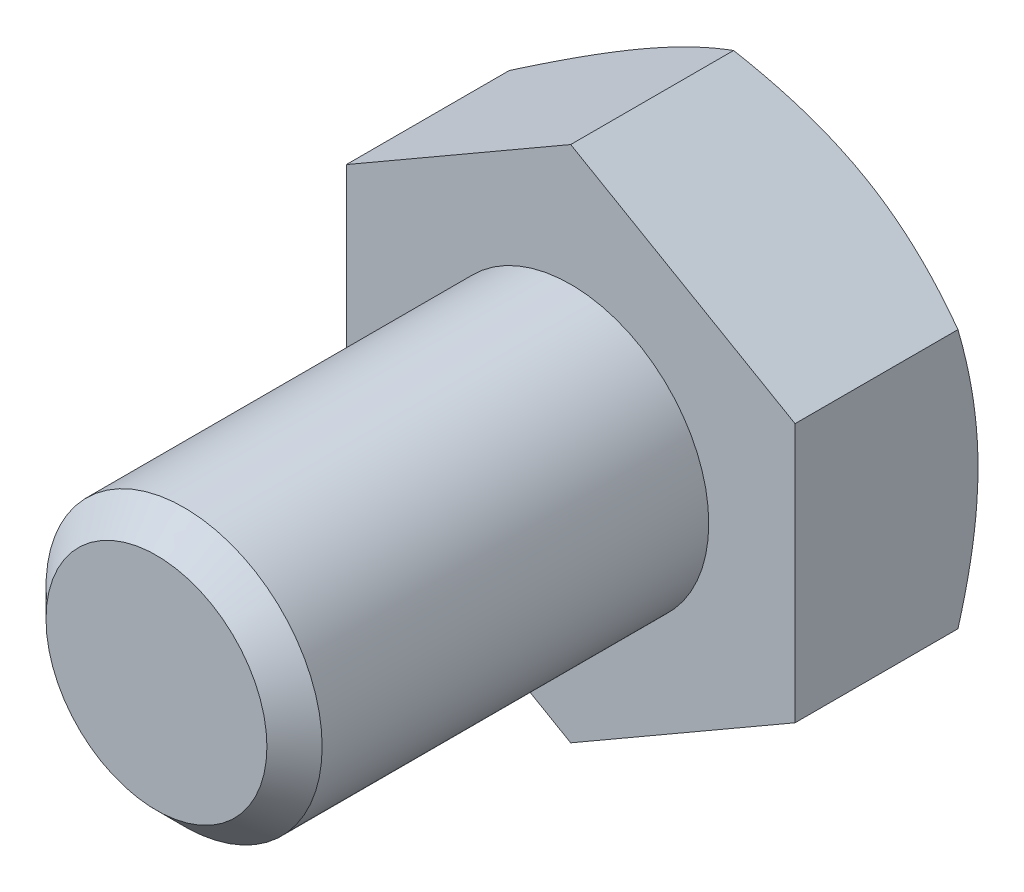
ISO-10303-21;
HEADER;
FILE_DESCRIPTION(('STEP AP214'),'2;1');
FILE_NAME('part.step','',(''),(''),'','','');
FILE_SCHEMA(('AUTOMOTIVE_DESIGN { 1 0 10303 214 1 1 1 1 }'));
ENDSEC;
DATA;
#1=APPLICATION_CONTEXT('core data for automotive mechanical design processes');
#2=APPLICATION_PROTOCOL_DEFINITION('international standard','automotive_design',2000,#1);
#3=PRODUCT_CONTEXT('',#1,'mechanical');
#4=PRODUCT('Part','Part','',(#3));
#5=PRODUCT_RELATED_PRODUCT_CATEGORY('part','',(#4));
#6=PRODUCT_DEFINITION_FORMATION('','',#4);
#7=PRODUCT_DEFINITION_CONTEXT('part definition',#1,'design');
#8=PRODUCT_DEFINITION('design','',#6,#7);
#9=PRODUCT_DEFINITION_SHAPE('','',#8);
#10=(LENGTH_UNIT() NAMED_UNIT(*) SI_UNIT(.MILLI.,.METRE.));
#11=(NAMED_UNIT(*) PLANE_ANGLE_UNIT() SI_UNIT($,.RADIAN.));
#12=(NAMED_UNIT(*) SI_UNIT($,.STERADIAN.) SOLID_ANGLE_UNIT());
#13=UNCERTAINTY_MEASURE_WITH_UNIT(LENGTH_MEASURE(1.E-05),#10,'distance_accuracy_value','');
#14=(GEOMETRIC_REPRESENTATION_CONTEXT(3) GLOBAL_UNCERTAINTY_ASSIGNED_CONTEXT((#13)) GLOBAL_UNIT_ASSIGNED_CONTEXT((#10,
#11,#12)) REPRESENTATION_CONTEXT('',''));
#15=CARTESIAN_POINT('',(0.,0.,0.));
#16=DIRECTION('',(0.,0.,1.));
#17=DIRECTION('',(1.,0.,0.));
#18=AXIS2_PLACEMENT_3D('',#15,#16,#17);
#19=CARTESIAN_POINT('',(0.,0.,12.));
#20=DIRECTION('',(0.,0.,1.));
#21=DIRECTION('',(1.,0.,0.));
#22=AXIS2_PLACEMENT_3D('',#19,#20,#21);
#23=PLANE('',#22);
#24=CARTESIAN_POINT('',(0.,0.,12.));
#25=DIRECTION('',(0.,0.,1.));
#26=DIRECTION('',(1.,0.,0.));
#27=AXIS2_PLACEMENT_3D('',#24,#25,#26);
#28=CIRCLE('',#27,3.2);
#29=CARTESIAN_POINT('',(3.2,0.,12.));
#30=VERTEX_POINT('',#29);
#31=EDGE_CURVE('E271',#30,#30,#28,.T.);
#32=ORIENTED_EDGE('',*,*,#31,.T.);
#33=EDGE_LOOP('',(#32));
#34=FACE_BOUND('',#33,.T.);
#35=ADVANCED_FACE('F34',(#34),#23,.T.);
#36=CARTESIAN_POINT('',(0.,0.,0.));
#37=DIRECTION('',(0.,0.,1.));
#38=DIRECTION('',(1.,0.,0.));
#39=AXIS2_PLACEMENT_3D('',#36,#37,#38);
#40=CYLINDRICAL_SURFACE('',#39,4.);
#41=CARTESIAN_POINT('',(0.,0.,11.2));
#42=DIRECTION('',(0.,0.,1.));
#43=DIRECTION('',(1.,0.,0.));
#44=AXIS2_PLACEMENT_3D('',#41,#42,#43);
#45=CIRCLE('',#44,4.);
#46=CARTESIAN_POINT('',(4.,0.,11.2));
#47=VERTEX_POINT('',#46);
#48=EDGE_CURVE('E242',#47,#47,#45,.F.);
#49=ORIENTED_EDGE('',*,*,#48,.T.);
#50=EDGE_LOOP('',(#49));
#51=FACE_BOUND('',#50,.T.);
#52=CARTESIAN_POINT('',(0.,0.,0.));
#53=DIRECTION('',(0.,0.,1.));
#54=DIRECTION('',(1.,0.,0.));
#55=AXIS2_PLACEMENT_3D('',#52,#53,#54);
#56=CIRCLE('',#55,4.);
#57=CARTESIAN_POINT('',(4.,0.,0.));
#58=VERTEX_POINT('',#57);
#59=EDGE_CURVE('E268',#58,#58,#56,.F.);
#60=ORIENTED_EDGE('',*,*,#59,.F.);
#61=EDGE_LOOP('',(#60));
#62=FACE_BOUND('',#61,.T.);
#63=ADVANCED_FACE('F206',(#51,#62),#40,.T.);
#64=CARTESIAN_POINT('',(0.,0.,12.));
#65=DIRECTION('',(0.,0.,-1.));
#66=DIRECTION('',(-1.,0.,0.));
#67=AXIS2_PLACEMENT_3D('',#64,#65,#66);
#68=CONICAL_SURFACE('',#67,3.2,0.785398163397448);
#69=ORIENTED_EDGE('',*,*,#48,.F.);
#70=EDGE_LOOP('',(#69));
#71=FACE_BOUND('',#70,.T.);
#72=ORIENTED_EDGE('',*,*,#31,.F.);
#73=EDGE_LOOP('',(#72));
#74=FACE_BOUND('',#73,.T.);
#75=ADVANCED_FACE('F36',(#71,#74),#68,.T.);
#76=CARTESIAN_POINT('',(0.,7.50555349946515,-5.3));
#77=DIRECTION('',(0.499999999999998,0.86602540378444,0.));
#78=DIRECTION('',(-0.86602540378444,0.499999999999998,0.));
#79=AXIS2_PLACEMENT_3D('',#76,#77,#78);
#80=PLANE('',#79);
#81=CARTESIAN_POINT('',(-0.000200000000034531,7.50566896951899,-4.71937674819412));
#82=CARTESIAN_POINT('',(0.142677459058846,7.42317863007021,-4.7669955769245));
#83=CARTESIAN_POINT('',(0.286087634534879,7.3403807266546,-4.81245329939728));
#84=CARTESIAN_POINT('',(0.574072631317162,7.17411251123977,-4.89845131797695));
#85=CARTESIAN_POINT('',(0.718647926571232,7.09064192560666,-4.93898949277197));
#86=CARTESIAN_POINT('',(1.15468865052,6.8388936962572,-5.05242899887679));
#87=CARTESIAN_POINT('',(1.44787528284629,6.66962231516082,-5.11695219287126));
#88=CARTESIAN_POINT('',(1.88662374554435,6.41631077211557,-5.19261341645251));
#89=CARTESIAN_POINT('',(2.03087463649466,6.33302748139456,-5.21416714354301));
#90=CARTESIAN_POINT('',(2.32002821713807,6.16608458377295,-5.25030968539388));
#91=CARTESIAN_POINT('',(2.46493084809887,6.08242501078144,-5.26489911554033));
#92=CARTESIAN_POINT('',(2.7549877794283,5.91496056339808,-5.28674124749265));
#93=CARTESIAN_POINT('',(2.90014160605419,5.83115596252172,-5.29400227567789));
#94=CARTESIAN_POINT('',(3.19057533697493,5.66347396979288,-5.30103969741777));
#95=CARTESIAN_POINT('',(3.33585523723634,5.57959658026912,-5.30081632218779));
#96=CARTESIAN_POINT('',(3.73387594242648,5.34979921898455,-5.28991654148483));
#97=CARTESIAN_POINT('',(3.98648646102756,5.20395446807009,-5.27161818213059));
#98=CARTESIAN_POINT('',(4.49002967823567,4.91323365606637,-5.21359365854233));
#99=CARTESIAN_POINT('',(4.74096060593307,4.76835861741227,-5.17384766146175));
#100=CARTESIAN_POINT('',(5.24551722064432,4.47705272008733,-5.07449409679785));
#101=CARTESIAN_POINT('',(5.49907924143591,4.33065861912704,-5.01446557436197));
#102=CARTESIAN_POINT('',(6.00242193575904,4.04005357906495,-4.87822500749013));
#103=CARTESIAN_POINT('',(6.25220905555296,3.89583891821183,-4.8020449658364));
#104=CARTESIAN_POINT('',(6.5002,3.75266127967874,-4.71937674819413));
#105=B_SPLINE_CURVE_WITH_KNOTS('',3,(#81,#82,#83,#84,#85,#86,#87,#88,#89,#90,#91,#92,#93,#94,
#95,#96,#97,#98,#99,#100,#101,#102,#103,#104),.UNSPECIFIED.,.F.,.F.,(4,2,2,2,2,2,2,2,2,2,2,4),
(0.,0.515105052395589,1.03043143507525,2.06322554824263,2.56697389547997,3.07067772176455,
3.57380860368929,4.07692394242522,4.95279354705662,5.82947446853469,6.72559912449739,
7.61996451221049),.UNSPECIFIED.);
#106=CARTESIAN_POINT('',(0.,7.50555349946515,-4.71944341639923));
#107=VERTEX_POINT('',#106);
#108=CARTESIAN_POINT('',(3.24999999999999,5.62916512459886,-5.3));
#109=VERTEX_POINT('',#108);
#110=EDGE_CURVE('E230',#107,#109,#105,.T.);
#111=ORIENTED_EDGE('',*,*,#110,.F.);
#112=DIRECTION('',(0.,0.,1.));
#113=VECTOR('',#112,1.);
#114=CARTESIAN_POINT('',(0.,7.50555349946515,-5.3));
#115=LINE('',#114,#113);
#116=CARTESIAN_POINT('',(0.,7.50555349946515,0.));
#117=VERTEX_POINT('',#116);
#118=EDGE_CURVE('E227',#107,#117,#115,.T.);
#119=ORIENTED_EDGE('',*,*,#118,.T.);
#120=DIRECTION('',(-0.86602540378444,0.499999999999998,0.));
#121=VECTOR('',#120,1.);
#122=CARTESIAN_POINT('',(0.,7.50555349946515,0.));
#123=LINE('',#122,#121);
#124=CARTESIAN_POINT('',(6.5,3.75277674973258,0.));
#125=VERTEX_POINT('',#124);
#126=EDGE_CURVE('E235',#125,#117,#123,.T.);
#127=ORIENTED_EDGE('',*,*,#126,.F.);
#128=DIRECTION('',(0.,0.,1.));
#129=VECTOR('',#128,1.);
#130=CARTESIAN_POINT('',(6.5,3.75277674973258,-5.3));
#131=LINE('',#130,#129);
#132=CARTESIAN_POINT('',(6.5,3.75277674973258,-4.71944341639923));
#133=VERTEX_POINT('',#132);
#134=EDGE_CURVE('E260',#133,#125,#131,.T.);
#135=ORIENTED_EDGE('',*,*,#134,.F.);
#136=EDGE_CURVE('E179',#109,#133,#105,.T.);
#137=ORIENTED_EDGE('',*,*,#136,.F.);
#138=EDGE_LOOP('',(#111,#119,#127,#135,#137));
#139=FACE_BOUND('',#138,.T.);
#140=ADVANCED_FACE('F190',(#139),#80,.T.);
#141=CARTESIAN_POINT('',(6.5,-3.75277674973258,-5.3));
#142=DIRECTION('',(1.,0.,0.));
#143=DIRECTION('',(0.,0.,-1.));
#144=AXIS2_PLACEMENT_3D('',#141,#142,#143);
#145=PLANE('',#144);
#146=CARTESIAN_POINT('',(6.5,-10.2428264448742,-2.04883753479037));
#147=CARTESIAN_POINT('',(6.5,-9.95749123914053,-2.18789595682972));
#148=CARTESIAN_POINT('',(6.5,-9.67151814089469,-2.32566707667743));
#149=CARTESIAN_POINT('',(6.5,-9.0979574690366,-2.59791370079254));
#150=CARTESIAN_POINT('',(6.5,-8.81036966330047,-2.73238871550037));
#151=CARTESIAN_POINT('',(6.5,-8.23183597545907,-2.99796413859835));
#152=CARTESIAN_POINT('',(6.5,-7.94088042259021,-3.12904355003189));
#153=CARTESIAN_POINT('',(6.5,-7.35671087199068,-3.38604980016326));
#154=CARTESIAN_POINT('',(6.5,-7.06349697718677,-3.51197687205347));
#155=CARTESIAN_POINT('',(6.5,-6.46434920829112,-3.7614858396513));
#156=CARTESIAN_POINT('',(6.5,-6.15832132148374,-3.88484316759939));
#157=CARTESIAN_POINT('',(6.5,-5.54274557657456,-4.12260875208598));
#158=CARTESIAN_POINT('',(6.5,-5.23319733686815,-4.2370160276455));
#159=CARTESIAN_POINT('',(6.5,-4.61061796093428,-4.45399730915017));
#160=CARTESIAN_POINT('',(6.5,-4.29759477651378,-4.5565939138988));
#161=CARTESIAN_POINT('',(6.5,-3.66705774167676,-4.74676876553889));
#162=CARTESIAN_POINT('',(6.5,-3.34954528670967,-4.83435157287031));
#163=CARTESIAN_POINT('',(6.5,-2.71162315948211,-4.98994277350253));
#164=CARTESIAN_POINT('',(6.5,-2.3912406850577,-5.05806094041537));
#165=CARTESIAN_POINT('',(6.5,-1.74628166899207,-5.17096432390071));
#166=CARTESIAN_POINT('',(6.5,-1.4217055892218,-5.2157520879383));
#167=CARTESIAN_POINT('',(6.5,-0.935153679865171,-5.26247031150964));
#168=CARTESIAN_POINT('',(6.5,-0.774120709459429,-5.27461755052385));
#169=CARTESIAN_POINT('',(6.5,-0.451677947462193,-5.29209027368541));
#170=CARTESIAN_POINT('',(6.5,-0.290268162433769,-5.29741587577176));
#171=CARTESIAN_POINT('',(6.5,0.0326315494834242,-5.30111032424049));
#172=CARTESIAN_POINT('',(6.5,0.194121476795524,-5.29947913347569));
#173=CARTESIAN_POINT('',(6.5,0.516885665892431,-5.28930353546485));
#174=CARTESIAN_POINT('',(6.5,0.678159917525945,-5.2807588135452));
#175=CARTESIAN_POINT('',(6.5,1.06087214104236,-5.2524625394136));
#176=CARTESIAN_POINT('',(6.5,1.28209274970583,-5.22970222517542));
#177=CARTESIAN_POINT('',(6.5,1.72298724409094,-5.17237790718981));
#178=CARTESIAN_POINT('',(6.5,1.94266093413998,-5.13781243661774));
#179=CARTESIAN_POINT('',(6.5,2.59905068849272,-5.01823337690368));
#180=CARTESIAN_POINT('',(6.5,3.03292018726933,-4.91735524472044));
#181=CARTESIAN_POINT('',(6.5,3.68203059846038,-4.74117763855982));
#182=CARTESIAN_POINT('',(6.5,3.90060192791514,-4.67743243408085));
#183=CARTESIAN_POINT('',(6.5,4.33562456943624,-4.54301317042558));
#184=CARTESIAN_POINT('',(6.5,4.55207586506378,-4.47233905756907));
#185=CARTESIAN_POINT('',(6.5,4.98292314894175,-4.3252213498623));
#186=CARTESIAN_POINT('',(6.5,5.19731969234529,-4.24877936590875));
#187=CARTESIAN_POINT('',(6.5,5.6243136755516,-4.09105605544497));
#188=CARTESIAN_POINT('',(6.5,5.83691115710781,-4.00977484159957));
#189=CARTESIAN_POINT('',(6.5,6.41107024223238,-3.78396124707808));
#190=CARTESIAN_POINT('',(6.5,6.77109993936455,-3.63553740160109));
#191=CARTESIAN_POINT('',(6.5,7.48742894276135,-3.32991367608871));
#192=CARTESIAN_POINT('',(6.5,7.84372782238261,-3.17271280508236));
#193=CARTESIAN_POINT('',(6.5,8.55345570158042,-2.85162072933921));
#194=CARTESIAN_POINT('',(6.5,8.90688352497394,-2.68772693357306));
#195=CARTESIAN_POINT('',(6.5,9.6113113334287,-2.35485675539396));
#196=CARTESIAN_POINT('',(6.5,9.9623114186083,-2.18588058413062));
#197=CARTESIAN_POINT('',(6.5,10.6629371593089,-1.84367823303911));
#198=CARTESIAN_POINT('',(6.5,11.012559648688,-1.67044558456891));
#199=CARTESIAN_POINT('',(6.5,11.7102232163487,-1.32082260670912));
#200=CARTESIAN_POINT('',(6.5,12.058264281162,-1.14443225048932));
#201=CARTESIAN_POINT('',(6.5,12.7529700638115,-0.78915631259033));
#202=CARTESIAN_POINT('',(6.5,13.099635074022,-0.610271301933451));
#203=CARTESIAN_POINT('',(6.5,13.7918918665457,-0.25043541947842));
#204=CARTESIAN_POINT('',(6.5,14.1374836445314,-0.0694845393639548));
#205=CARTESIAN_POINT('',(6.5,15.099399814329,0.437179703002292));
#206=CARTESIAN_POINT('',(6.5,15.7147468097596,0.764748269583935));
#207=CARTESIAN_POINT('',(6.5,16.9433793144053,1.42381233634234));
#208=CARTESIAN_POINT('',(6.5,17.5566646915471,1.7553080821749));
#209=CARTESIAN_POINT('',(6.5,18.779571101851,2.4200871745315));
#210=CARTESIAN_POINT('',(6.5,19.3891975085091,2.75336064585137));
#211=CARTESIAN_POINT('',(6.5,20.6071616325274,3.42213981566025));
#212=CARTESIAN_POINT('',(6.5,21.2154994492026,3.75764533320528));
#213=CARTESIAN_POINT('',(6.5,21.8233856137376,4.09396124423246));
#214=B_SPLINE_CURVE_WITH_KNOTS('',3,(#146,#147,#148,#149,#150,#151,#152,#153,#154,#155,#156,
#157,#158,#159,#160,#161,#162,#163,#164,#165,#166,#167,#168,#169,#170,#171,#172,#173,#174,#175,
#176,#177,#178,#179,#180,#181,#182,#183,#184,#185,#186,#187,#188,#189,#190,#191,#192,#193,#194,
#195,#196,#197,#198,#199,#200,#201,#202,#203,#204,#205,#206,#207,#208,#209,#210,#211,#212,#213),
.UNSPECIFIED.,.F.,.F.,(4,2,2,2,2,2,2,2,2,2,2,2,2,2,2,2,2,2,2,2,2,2,2,2,2,2,2,2,2,2,2,2,2,4),(0.,
0.952261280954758,1.90466315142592,2.8619801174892,3.81925370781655,4.8090096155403,
5.798873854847,6.78681142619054,7.7744483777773,8.75640022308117,9.73824482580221,
10.2225937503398,10.7069343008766,11.1912774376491,11.6756426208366,12.3424346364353,
13.0093095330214,14.3437044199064,15.0266742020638,15.7096492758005,16.3924343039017,
17.0752034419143,18.2433007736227,19.4115302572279,20.580216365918,21.7488539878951,
22.9193933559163,24.0899426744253,25.2602283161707,26.4305186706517,28.5218066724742,
30.6132261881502,32.6975528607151,34.7817125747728),.UNSPECIFIED.);
#215=CARTESIAN_POINT('',(6.5,0.,-5.3));
#216=VERTEX_POINT('',#215);
#217=EDGE_CURVE('E177',#133,#216,#214,.F.);
#218=ORIENTED_EDGE('',*,*,#217,.F.);
#219=ORIENTED_EDGE('',*,*,#134,.T.);
#220=DIRECTION('',(0.,1.,0.));
#221=VECTOR('',#220,1.);
#222=CARTESIAN_POINT('',(6.5,-3.75277674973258,0.));
#223=LINE('',#222,#221);
#224=CARTESIAN_POINT('',(6.5,-3.75277674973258,0.));
#225=VERTEX_POINT('',#224);
#226=EDGE_CURVE('E267',#225,#125,#223,.T.);
#227=ORIENTED_EDGE('',*,*,#226,.F.);
#228=DIRECTION('',(0.,0.,1.));
#229=VECTOR('',#228,1.);
#230=CARTESIAN_POINT('',(6.5,-3.75277674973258,-5.3));
#231=LINE('',#230,#229);
#232=CARTESIAN_POINT('',(6.5,-3.75277674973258,-4.71944341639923));
#233=VERTEX_POINT('',#232);
#234=EDGE_CURVE('E245',#233,#225,#231,.T.);
#235=ORIENTED_EDGE('',*,*,#234,.F.);
#236=EDGE_CURVE('E171',#216,#233,#214,.F.);
#237=ORIENTED_EDGE('',*,*,#236,.F.);
#238=EDGE_LOOP('',(#218,#219,#227,#235,#237));
#239=FACE_BOUND('',#238,.T.);
#240=ADVANCED_FACE('F186',(#239),#145,.T.);
#241=CARTESIAN_POINT('',(0.,-7.50555349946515,-5.3));
#242=DIRECTION('',(0.499999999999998,-0.86602540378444,0.));
#243=DIRECTION('',(0.86602540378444,0.499999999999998,0.));
#244=AXIS2_PLACEMENT_3D('',#241,#242,#243);
#245=PLANE('',#244);
#246=CARTESIAN_POINT('',(6.5002,-3.75266127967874,-4.71937674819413));
#247=CARTESIAN_POINT('',(6.35732254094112,-3.83515161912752,-4.76699557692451));
#248=CARTESIAN_POINT('',(6.21391236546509,-3.91794952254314,-4.81245329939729));
#249=CARTESIAN_POINT('',(5.92592736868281,-4.08421773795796,-4.89845131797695));
#250=CARTESIAN_POINT('',(5.78135207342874,-4.16768832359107,-4.93898949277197));
#251=CARTESIAN_POINT('',(5.34531134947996,-4.41943655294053,-5.05242899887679));
#252=CARTESIAN_POINT('',(5.05212471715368,-4.58870793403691,-5.11695219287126));
#253=CARTESIAN_POINT('',(4.61337625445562,-4.84201947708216,-5.19261341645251));
#254=CARTESIAN_POINT('',(4.46912536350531,-4.92530276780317,-5.21416714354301));
#255=CARTESIAN_POINT('',(4.17997178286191,-5.09224566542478,-5.25030968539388));
#256=CARTESIAN_POINT('',(4.03506915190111,-5.17590523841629,-5.26489911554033));
#257=CARTESIAN_POINT('',(3.74501222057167,-5.34336968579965,-5.28674124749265));
#258=CARTESIAN_POINT('',(3.59985839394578,-5.42717428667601,-5.29400227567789));
#259=CARTESIAN_POINT('',(3.30942466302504,-5.59485627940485,-5.30103969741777));
#260=CARTESIAN_POINT('',(3.16414476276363,-5.67873366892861,-5.30081632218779));
#261=CARTESIAN_POINT('',(2.76612405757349,-5.90853103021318,-5.28991654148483));
#262=CARTESIAN_POINT('',(2.51351353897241,-6.05437578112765,-5.27161818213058));
#263=CARTESIAN_POINT('',(2.0099703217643,-6.34509659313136,-5.21359365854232));
#264=CARTESIAN_POINT('',(1.7590393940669,-6.48997163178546,-5.17384766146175));
#265=CARTESIAN_POINT('',(1.25448277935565,-6.7812775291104,-5.07449409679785));
#266=CARTESIAN_POINT('',(1.00092075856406,-6.92767163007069,-5.01446557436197));
#267=CARTESIAN_POINT('',(0.497578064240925,-7.21827667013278,-4.87822500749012));
#268=CARTESIAN_POINT('',(0.247790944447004,-7.3624913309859,-4.8020449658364));
#269=CARTESIAN_POINT('',(-0.000200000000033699,-7.50566896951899,-4.71937674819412));
#270=B_SPLINE_CURVE_WITH_KNOTS('',3,(#246,#247,#248,#249,#250,#251,#252,#253,#254,#255,#256,
#257,#258,#259,#260,#261,#262,#263,#264,#265,#266,#267,#268,#269),.UNSPECIFIED.,.F.,.F.,(4,2,2,
2,2,2,2,2,2,2,2,4),(0.,0.515105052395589,1.03043143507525,2.06322554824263,2.56697389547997,
3.07067772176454,3.57380860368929,4.07692394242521,4.95279354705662,5.82947446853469,
6.72559912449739,7.61996451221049),.UNSPECIFIED.);
#271=CARTESIAN_POINT('',(3.24999999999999,-5.62916512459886,-5.3));
#272=VERTEX_POINT('',#271);
#273=EDGE_CURVE('E178',#233,#272,#270,.T.);
#274=ORIENTED_EDGE('',*,*,#273,.F.);
#275=ORIENTED_EDGE('',*,*,#234,.T.);
#276=DIRECTION('',(0.86602540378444,0.499999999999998,0.));
#277=VECTOR('',#276,1.);
#278=CARTESIAN_POINT('',(0.,-7.50555349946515,0.));
#279=LINE('',#278,#277);
#280=CARTESIAN_POINT('',(0.,-7.50555349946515,0.));
#281=VERTEX_POINT('',#280);
#282=EDGE_CURVE('E256',#281,#225,#279,.T.);
#283=ORIENTED_EDGE('',*,*,#282,.F.);
#284=DIRECTION('',(0.,0.,1.));
#285=VECTOR('',#284,1.);
#286=CARTESIAN_POINT('',(0.,-7.50555349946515,-5.3));
#287=LINE('',#286,#285);
#288=CARTESIAN_POINT('',(0.,-7.50555349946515,-4.71944341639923));
#289=VERTEX_POINT('',#288);
#290=EDGE_CURVE('E255',#289,#281,#287,.T.);
#291=ORIENTED_EDGE('',*,*,#290,.F.);
#292=EDGE_CURVE('E164',#272,#289,#270,.T.);
#293=ORIENTED_EDGE('',*,*,#292,.F.);
#294=EDGE_LOOP('',(#274,#275,#283,#291,#293));
#295=FACE_BOUND('',#294,.T.);
#296=ADVANCED_FACE('F189',(#295),#245,.T.);
#297=CARTESIAN_POINT('',(0.,-7.50555349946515,-5.3));
#298=DIRECTION('',(-0.500000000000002,-0.866025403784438,0.));
#299=DIRECTION('',(0.866025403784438,-0.500000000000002,0.));
#300=AXIS2_PLACEMENT_3D('',#297,#298,#299);
#301=PLANE('',#300);
#302=CARTESIAN_POINT('',(0.000199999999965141,-7.50566896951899,-4.71937674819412));
#303=CARTESIAN_POINT('',(-0.142677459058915,-7.42317863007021,-4.7669955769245));
#304=CARTESIAN_POINT('',(-0.286087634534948,-7.34038072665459,-4.81245329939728));
#305=CARTESIAN_POINT('',(-0.57407263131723,-7.17411251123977,-4.89845131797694));
#306=CARTESIAN_POINT('',(-0.7186479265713,-7.09064192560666,-4.93898949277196));
#307=CARTESIAN_POINT('',(-1.15468865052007,-6.8388936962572,-5.05242899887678));
#308=CARTESIAN_POINT('',(-1.44787528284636,-6.66962231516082,-5.11695219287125));
#309=CARTESIAN_POINT('',(-1.88662374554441,-6.41631077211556,-5.1926134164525));
#310=CARTESIAN_POINT('',(-2.03087463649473,-6.33302748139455,-5.214167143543));
#311=CARTESIAN_POINT('',(-2.32002821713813,-6.16608458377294,-5.25030968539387));
#312=CARTESIAN_POINT('',(-2.46493084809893,-6.08242501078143,-5.26489911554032));
#313=CARTESIAN_POINT('',(-2.75498777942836,-5.91496056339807,-5.28674124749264));
#314=CARTESIAN_POINT('',(-2.90014160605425,-5.83115596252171,-5.29400227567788));
#315=CARTESIAN_POINT('',(-3.19057533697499,-5.66347396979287,-5.30103969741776));
#316=CARTESIAN_POINT('',(-3.3358552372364,-5.5795965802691,-5.30081632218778));
#317=CARTESIAN_POINT('',(-3.73387594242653,-5.34979921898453,-5.28991654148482));
#318=CARTESIAN_POINT('',(-3.98648646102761,-5.20395446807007,-5.27161818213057));
#319=CARTESIAN_POINT('',(-4.49002967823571,-4.91323365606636,-5.21359365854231));
#320=CARTESIAN_POINT('',(-4.74096060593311,-4.76835861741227,-5.17384766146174));
#321=CARTESIAN_POINT('',(-5.24551722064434,-4.47705272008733,-5.07449409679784));
#322=CARTESIAN_POINT('',(-5.49907924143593,-4.33065861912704,-5.01446557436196));
#323=CARTESIAN_POINT('',(-6.00242193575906,-4.04005357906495,-4.87822500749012));
#324=CARTESIAN_POINT('',(-6.25220905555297,-3.89583891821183,-4.8020449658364));
#325=CARTESIAN_POINT('',(-6.5002,-3.75266127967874,-4.71937674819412));
#326=B_SPLINE_CURVE_WITH_KNOTS('',3,(#302,#303,#304,#305,#306,#307,#308,#309,#310,#311,#312,
#313,#314,#315,#316,#317,#318,#319,#320,#321,#322,#323,#324,#325),.UNSPECIFIED.,.F.,.F.,(4,2,2,
2,2,2,2,2,2,2,2,4),(0.,0.515105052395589,1.03043143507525,2.06322554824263,2.56697389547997,
3.07067772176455,3.57380860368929,4.07692394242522,4.9527935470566,5.82947446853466,
6.72559912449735,7.61996451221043),.UNSPECIFIED.);
#327=CARTESIAN_POINT('',(-3.25000000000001,-5.62916512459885,-5.3));
#328=VERTEX_POINT('',#327);
#329=EDGE_CURVE('E251',#289,#328,#326,.T.);
#330=ORIENTED_EDGE('',*,*,#329,.F.);
#331=ORIENTED_EDGE('',*,*,#290,.T.);
#332=DIRECTION('',(0.866025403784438,-0.500000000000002,0.));
#333=VECTOR('',#332,1.);
#334=CARTESIAN_POINT('',(0.,-7.50555349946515,0.));
#335=LINE('',#334,#333);
#336=CARTESIAN_POINT('',(-6.5,-3.75277674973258,0.));
#337=VERTEX_POINT('',#336);
#338=EDGE_CURVE('E389',#337,#281,#335,.T.);
#339=ORIENTED_EDGE('',*,*,#338,.F.);
#340=DIRECTION('',(0.,0.,1.));
#341=VECTOR('',#340,1.);
#342=CARTESIAN_POINT('',(-6.5,-3.75277674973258,-5.3));
#343=LINE('',#342,#341);
#344=CARTESIAN_POINT('',(-6.5,-3.75277674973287,-4.71944341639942));
#345=VERTEX_POINT('',#344);
#346=EDGE_CURVE('E258',#345,#337,#343,.T.);
#347=ORIENTED_EDGE('',*,*,#346,.F.);
#348=EDGE_CURVE('E111',#328,#345,#326,.T.);
#349=ORIENTED_EDGE('',*,*,#348,.F.);
#350=EDGE_LOOP('',(#330,#331,#339,#347,#349));
#351=FACE_BOUND('',#350,.T.);
#352=ADVANCED_FACE('F195',(#351),#301,.T.);
#353=CARTESIAN_POINT('',(-6.5,-3.75277674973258,-5.3));
#354=DIRECTION('',(-1.,0.,0.));
#355=DIRECTION('',(0.,0.,1.));
#356=AXIS2_PLACEMENT_3D('',#353,#354,#355);
#357=PLANE('',#356);
#358=CARTESIAN_POINT('',(-6.5,-10.2428264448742,-2.04883753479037));
#359=CARTESIAN_POINT('',(-6.5,-9.95749123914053,-2.18789595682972));
#360=CARTESIAN_POINT('',(-6.5,-9.67151814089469,-2.32566707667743));
#361=CARTESIAN_POINT('',(-6.5,-9.0979574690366,-2.59791370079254));
#362=CARTESIAN_POINT('',(-6.5,-8.81036966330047,-2.73238871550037));
#363=CARTESIAN_POINT('',(-6.5,-8.23183597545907,-2.99796413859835));
#364=CARTESIAN_POINT('',(-6.5,-7.94088042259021,-3.12904355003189));
#365=CARTESIAN_POINT('',(-6.5,-7.35671087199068,-3.38604980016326));
#366=CARTESIAN_POINT('',(-6.5,-7.06349697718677,-3.51197687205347));
#367=CARTESIAN_POINT('',(-6.5,-6.46434920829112,-3.7614858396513));
#368=CARTESIAN_POINT('',(-6.5,-6.15832132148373,-3.88484316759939));
#369=CARTESIAN_POINT('',(-6.5,-5.54274557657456,-4.12260875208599));
#370=CARTESIAN_POINT('',(-6.5,-5.23319733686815,-4.2370160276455));
#371=CARTESIAN_POINT('',(-6.5,-4.61061796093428,-4.45399730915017));
#372=CARTESIAN_POINT('',(-6.5,-4.29759477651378,-4.5565939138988));
#373=CARTESIAN_POINT('',(-6.5,-3.66705774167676,-4.74676876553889));
#374=CARTESIAN_POINT('',(-6.5,-3.34954528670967,-4.83435157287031));
#375=CARTESIAN_POINT('',(-6.5,-2.71162315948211,-4.98994277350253));
#376=CARTESIAN_POINT('',(-6.5,-2.3912406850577,-5.05806094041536));
#377=CARTESIAN_POINT('',(-6.5,-1.74628166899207,-5.17096432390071));
#378=CARTESIAN_POINT('',(-6.5,-1.42170558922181,-5.2157520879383));
#379=CARTESIAN_POINT('',(-6.5,-0.935153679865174,-5.26247031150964));
#380=CARTESIAN_POINT('',(-6.5,-0.774120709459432,-5.27461755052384));
#381=CARTESIAN_POINT('',(-6.5,-0.451677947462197,-5.29209027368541));
#382=CARTESIAN_POINT('',(-6.5,-0.290268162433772,-5.29741587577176));
#383=CARTESIAN_POINT('',(-6.5,0.0326315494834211,-5.30111032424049));
#384=CARTESIAN_POINT('',(-6.5,0.194121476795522,-5.29947913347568));
#385=CARTESIAN_POINT('',(-6.5,0.516885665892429,-5.28930353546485));
#386=CARTESIAN_POINT('',(-6.5,0.678159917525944,-5.2807588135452));
#387=CARTESIAN_POINT('',(-6.5,1.06087214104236,-5.2524625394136));
#388=CARTESIAN_POINT('',(-6.5,1.28209274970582,-5.22970222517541));
#389=CARTESIAN_POINT('',(-6.5,1.72298724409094,-5.17237790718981));
#390=CARTESIAN_POINT('',(-6.5,1.94266093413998,-5.13781243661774));
#391=CARTESIAN_POINT('',(-6.5,2.59905068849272,-5.01823337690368));
#392=CARTESIAN_POINT('',(-6.5,3.03292018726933,-4.91735524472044));
#393=CARTESIAN_POINT('',(-6.5,3.68203059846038,-4.74117763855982));
#394=CARTESIAN_POINT('',(-6.5,3.90060192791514,-4.67743243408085));
#395=CARTESIAN_POINT('',(-6.5,4.33562456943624,-4.54301317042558));
#396=CARTESIAN_POINT('',(-6.5,4.55207586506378,-4.47233905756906));
#397=CARTESIAN_POINT('',(-6.5,4.98292314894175,-4.3252213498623));
#398=CARTESIAN_POINT('',(-6.5,5.1973196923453,-4.24877936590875));
#399=CARTESIAN_POINT('',(-6.5,5.6243136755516,-4.09105605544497));
#400=CARTESIAN_POINT('',(-6.5,5.83691115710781,-4.00977484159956));
#401=CARTESIAN_POINT('',(-6.5,6.41107024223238,-3.78396124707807));
#402=CARTESIAN_POINT('',(-6.5,6.77109993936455,-3.63553740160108));
#403=CARTESIAN_POINT('',(-6.5,7.48742894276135,-3.32991367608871));
#404=CARTESIAN_POINT('',(-6.5,7.84372782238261,-3.17271280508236));
#405=CARTESIAN_POINT('',(-6.5,8.55345570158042,-2.8516207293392));
#406=CARTESIAN_POINT('',(-6.5,8.90688352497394,-2.68772693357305));
#407=CARTESIAN_POINT('',(-6.5,9.6113113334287,-2.35485675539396));
#408=CARTESIAN_POINT('',(-6.5,9.9623114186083,-2.18588058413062));
#409=CARTESIAN_POINT('',(-6.5,10.6629371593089,-1.84367823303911));
#410=CARTESIAN_POINT('',(-6.5,11.012559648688,-1.67044558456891));
#411=CARTESIAN_POINT('',(-6.5,11.7102232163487,-1.32082260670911));
#412=CARTESIAN_POINT('',(-6.5,12.058264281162,-1.14443225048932));
#413=CARTESIAN_POINT('',(-6.5,12.7529700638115,-0.789156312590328));
#414=CARTESIAN_POINT('',(-6.5,13.099635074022,-0.610271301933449));
#415=CARTESIAN_POINT('',(-6.5,13.7918918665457,-0.25043541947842));
#416=CARTESIAN_POINT('',(-6.5,14.1374836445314,-0.0694845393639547));
#417=CARTESIAN_POINT('',(-6.5,15.099399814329,0.437179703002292));
#418=CARTESIAN_POINT('',(-6.5,15.7147468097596,0.764748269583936));
#419=CARTESIAN_POINT('',(-6.5,16.9433793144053,1.42381233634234));
#420=CARTESIAN_POINT('',(-6.5,17.5566646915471,1.7553080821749));
#421=CARTESIAN_POINT('',(-6.5,18.779571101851,2.4200871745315));
#422=CARTESIAN_POINT('',(-6.5,19.3891975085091,2.75336064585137));
#423=CARTESIAN_POINT('',(-6.5,20.6071616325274,3.42213981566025));
#424=CARTESIAN_POINT('',(-6.5,21.2154994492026,3.75764533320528));
#425=CARTESIAN_POINT('',(-6.5,21.8233856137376,4.09396124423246));
#426=B_SPLINE_CURVE_WITH_KNOTS('',3,(#358,#359,#360,#361,#362,#363,#364,#365,#366,#367,#368,
#369,#370,#371,#372,#373,#374,#375,#376,#377,#378,#379,#380,#381,#382,#383,#384,#385,#386,#387,
#388,#389,#390,#391,#392,#393,#394,#395,#396,#397,#398,#399,#400,#401,#402,#403,#404,#405,#406,
#407,#408,#409,#410,#411,#412,#413,#414,#415,#416,#417,#418,#419,#420,#421,#422,#423,#424,#425),
.UNSPECIFIED.,.F.,.F.,(4,2,2,2,2,2,2,2,2,2,2,2,2,2,2,2,2,2,2,2,2,2,2,2,2,2,2,2,2,2,2,2,2,4),(0.,
0.952261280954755,1.90466315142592,2.8619801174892,3.81925370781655,4.8090096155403,
5.798873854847,6.78681142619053,7.7744483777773,8.75640022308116,9.73824482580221,
10.2225937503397,10.7069343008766,11.1912774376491,11.6756426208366,12.3424346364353,
13.0093095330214,14.3437044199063,15.0266742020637,15.7096492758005,16.3924343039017,
17.0752034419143,18.2433007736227,19.4115302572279,20.580216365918,21.7488539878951,
22.9193933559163,24.0899426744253,25.2602283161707,26.4305186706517,28.5218066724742,
30.6132261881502,32.6975528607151,34.7817125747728),.UNSPECIFIED.);
#427=CARTESIAN_POINT('',(-6.5,0.,-5.3));
#428=VERTEX_POINT('',#427);
#429=EDGE_CURVE('E106',#345,#428,#426,.T.);
#430=ORIENTED_EDGE('',*,*,#429,.F.);
#431=ORIENTED_EDGE('',*,*,#346,.T.);
#432=DIRECTION('',(0.,-1.,0.));
#433=VECTOR('',#432,1.);
#434=CARTESIAN_POINT('',(-6.5,-3.75277674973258,0.));
#435=LINE('',#434,#433);
#436=CARTESIAN_POINT('',(-6.5,3.75277674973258,0.));
#437=VERTEX_POINT('',#436);
#438=EDGE_CURVE('E391',#437,#337,#435,.T.);
#439=ORIENTED_EDGE('',*,*,#438,.F.);
#440=DIRECTION('',(0.,0.,1.));
#441=VECTOR('',#440,1.);
#442=CARTESIAN_POINT('',(-6.5,3.75277674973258,-5.3));
#443=LINE('',#442,#441);
#444=CARTESIAN_POINT('',(-6.5,3.75277674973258,-4.71944341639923));
#445=VERTEX_POINT('',#444);
#446=EDGE_CURVE('E132',#445,#437,#443,.T.);
#447=ORIENTED_EDGE('',*,*,#446,.F.);
#448=EDGE_CURVE('E115',#428,#445,#426,.T.);
#449=ORIENTED_EDGE('',*,*,#448,.F.);
#450=EDGE_LOOP('',(#430,#431,#439,#447,#449));
#451=FACE_BOUND('',#450,.T.);
#452=ADVANCED_FACE('F130',(#451),#357,.T.);
#453=CARTESIAN_POINT('',(-6.5,3.75277674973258,-5.3));
#454=DIRECTION('',(-0.500000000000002,0.866025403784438,0.));
#455=DIRECTION('',(-0.866025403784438,-0.500000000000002,0.));
#456=AXIS2_PLACEMENT_3D('',#453,#454,#455);
#457=PLANE('',#456);
#458=CARTESIAN_POINT('',(-6.5002,3.75266127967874,-4.71937674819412));
#459=CARTESIAN_POINT('',(-6.35732254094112,3.83515161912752,-4.76699557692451));
#460=CARTESIAN_POINT('',(-6.21391236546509,3.91794952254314,-4.81245329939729));
#461=CARTESIAN_POINT('',(-5.92592736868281,4.08421773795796,-4.89845131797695));
#462=CARTESIAN_POINT('',(-5.78135207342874,4.16768832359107,-4.93898949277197));
#463=CARTESIAN_POINT('',(-5.34531134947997,4.41943655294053,-5.05242899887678));
#464=CARTESIAN_POINT('',(-5.05212471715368,4.58870793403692,-5.11695219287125));
#465=CARTESIAN_POINT('',(-4.61337625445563,4.84201947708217,-5.1926134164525));
#466=CARTESIAN_POINT('',(-4.46912536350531,4.92530276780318,-5.214167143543));
#467=CARTESIAN_POINT('',(-4.17997178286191,5.09224566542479,-5.25030968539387));
#468=CARTESIAN_POINT('',(-4.03506915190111,5.1759052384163,-5.26489911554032));
#469=CARTESIAN_POINT('',(-3.74501222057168,5.34336968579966,-5.28674124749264));
#470=CARTESIAN_POINT('',(-3.59985839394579,5.42717428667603,-5.29400227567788));
#471=CARTESIAN_POINT('',(-3.30942466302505,5.59485627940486,-5.30103969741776));
#472=CARTESIAN_POINT('',(-3.16414476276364,5.67873366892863,-5.30081632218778));
#473=CARTESIAN_POINT('',(-2.76612405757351,5.9085310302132,-5.28991654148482));
#474=CARTESIAN_POINT('',(-2.51351353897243,6.05437578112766,-5.27161818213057));
#475=CARTESIAN_POINT('',(-2.00997032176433,6.34509659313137,-5.21359365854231));
#476=CARTESIAN_POINT('',(-1.75903939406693,6.48997163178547,-5.17384766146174));
#477=CARTESIAN_POINT('',(-1.2544827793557,6.7812775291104,-5.07449409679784));
#478=CARTESIAN_POINT('',(-1.00092075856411,6.92767163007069,-5.01446557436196));
#479=CARTESIAN_POINT('',(-0.497578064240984,7.21827667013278,-4.87822500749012));
#480=CARTESIAN_POINT('',(-0.247790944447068,7.3624913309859,-4.80204496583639));
#481=CARTESIAN_POINT('',(0.000199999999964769,7.50566896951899,-4.71937674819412));
#482=B_SPLINE_CURVE_WITH_KNOTS('',3,(#458,#459,#460,#461,#462,#463,#464,#465,#466,#467,#468,
#469,#470,#471,#472,#473,#474,#475,#476,#477,#478,#479,#480,#481),.UNSPECIFIED.,.F.,.F.,(4,2,2,
2,2,2,2,2,2,2,2,4),(0.,0.515105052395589,1.03043143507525,2.06322554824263,2.56697389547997,
3.07067772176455,3.57380860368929,4.07692394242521,4.9527935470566,5.82947446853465,
6.72559912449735,7.61996451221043),.UNSPECIFIED.);
#483=CARTESIAN_POINT('',(-3.25000000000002,5.62916512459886,-5.3));
#484=VERTEX_POINT('',#483);
#485=EDGE_CURVE('E121',#445,#484,#482,.T.);
#486=ORIENTED_EDGE('',*,*,#485,.F.);
#487=ORIENTED_EDGE('',*,*,#446,.T.);
#488=DIRECTION('',(-0.866025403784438,-0.500000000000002,0.));
#489=VECTOR('',#488,1.);
#490=CARTESIAN_POINT('',(-6.5,3.75277674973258,0.));
#491=LINE('',#490,#489);
#492=EDGE_CURVE('E237',#117,#437,#491,.T.);
#493=ORIENTED_EDGE('',*,*,#492,.F.);
#494=ORIENTED_EDGE('',*,*,#118,.F.);
#495=EDGE_CURVE('E123',#484,#107,#482,.T.);
#496=ORIENTED_EDGE('',*,*,#495,.F.);
#497=EDGE_LOOP('',(#486,#487,#493,#494,#496));
#498=FACE_BOUND('',#497,.T.);
#499=ADVANCED_FACE('F203',(#498),#457,.T.);
#500=CARTESIAN_POINT('',(6.5,3.75277674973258,0.));
#501=DIRECTION('',(0.,0.,1.));
#502=DIRECTION('',(1.,0.,0.));
#503=AXIS2_PLACEMENT_3D('',#500,#501,#502);
#504=PLANE('',#503);
#505=ORIENTED_EDGE('',*,*,#59,.T.);
#506=EDGE_LOOP('',(#505));
#507=FACE_BOUND('',#506,.T.);
#508=ORIENTED_EDGE('',*,*,#126,.T.);
#509=ORIENTED_EDGE('',*,*,#492,.T.);
#510=ORIENTED_EDGE('',*,*,#438,.T.);
#511=ORIENTED_EDGE('',*,*,#338,.T.);
#512=ORIENTED_EDGE('',*,*,#282,.T.);
#513=ORIENTED_EDGE('',*,*,#226,.T.);
#514=EDGE_LOOP('',(#508,#509,#510,#511,#512,#513));
#515=FACE_BOUND('',#514,.T.);
#516=ADVANCED_FACE('F192',(#507,#515),#504,.T.);
#517=CARTESIAN_POINT('',(0.,0.,0.));
#518=DIRECTION('',(0.,0.,1.));
#519=DIRECTION('',(1.,0.,0.));
#520=AXIS2_PLACEMENT_3D('',#517,#518,#519);
#521=CONICAL_SURFACE('',#520,15.679869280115,1.0471975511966);
#522=ORIENTED_EDGE('',*,*,#136,.T.);
#523=ORIENTED_EDGE('',*,*,#217,.T.);
#524=CARTESIAN_POINT('',(0.,0.,-5.3));
#525=DIRECTION('',(0.,0.,1.));
#526=DIRECTION('',(1.,0.,0.));
#527=AXIS2_PLACEMENT_3D('',#524,#525,#526);
#528=CIRCLE('',#527,6.5);
#529=EDGE_CURVE('E38',#109,#216,#528,.F.);
#530=ORIENTED_EDGE('',*,*,#529,.F.);
#531=EDGE_LOOP('',(#522,#523,#530));
#532=FACE_BOUND('',#531,.T.);
#533=ADVANCED_FACE('F223',(#532),#521,.T.);
#534=ORIENTED_EDGE('',*,*,#110,.T.);
#535=EDGE_CURVE('E128',#484,#109,#528,.F.);
#536=ORIENTED_EDGE('',*,*,#535,.F.);
#537=ORIENTED_EDGE('',*,*,#495,.T.);
#538=EDGE_LOOP('',(#534,#536,#537));
#539=FACE_BOUND('',#538,.T.);
#540=ADVANCED_FACE('F156',(#539),#521,.T.);
#541=ORIENTED_EDGE('',*,*,#448,.T.);
#542=ORIENTED_EDGE('',*,*,#485,.T.);
#543=CARTESIAN_POINT('',(0.,0.,-5.3));
#544=DIRECTION('',(0.,0.,-1.));
#545=DIRECTION('',(-1.,0.,0.));
#546=AXIS2_PLACEMENT_3D('',#543,#544,#545);
#547=CIRCLE('',#546,6.5);
#548=EDGE_CURVE('E56',#428,#484,#547,.T.);
#549=ORIENTED_EDGE('',*,*,#548,.F.);
#550=EDGE_LOOP('',(#541,#542,#549));
#551=FACE_BOUND('',#550,.T.);
#552=ADVANCED_FACE('F119',(#551),#521,.T.);
#553=ORIENTED_EDGE('',*,*,#348,.T.);
#554=ORIENTED_EDGE('',*,*,#429,.T.);
#555=EDGE_CURVE('E108',#328,#428,#528,.F.);
#556=ORIENTED_EDGE('',*,*,#555,.F.);
#557=EDGE_LOOP('',(#553,#554,#556));
#558=FACE_BOUND('',#557,.T.);
#559=ADVANCED_FACE('F107',(#558),#521,.T.);
#560=ORIENTED_EDGE('',*,*,#292,.T.);
#561=ORIENTED_EDGE('',*,*,#329,.T.);
#562=EDGE_CURVE('E43',#272,#328,#528,.F.);
#563=ORIENTED_EDGE('',*,*,#562,.F.);
#564=EDGE_LOOP('',(#560,#561,#563));
#565=FACE_BOUND('',#564,.T.);
#566=ADVANCED_FACE('F253',(#565),#521,.T.);
#567=ORIENTED_EDGE('',*,*,#236,.T.);
#568=ORIENTED_EDGE('',*,*,#273,.T.);
#569=EDGE_CURVE('E11',#216,#272,#528,.F.);
#570=ORIENTED_EDGE('',*,*,#569,.F.);
#571=EDGE_LOOP('',(#567,#568,#570));
#572=FACE_BOUND('',#571,.T.);
#573=ADVANCED_FACE('F247',(#572),#521,.T.);
#574=CARTESIAN_POINT('',(6.5,3.75277674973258,-5.3));
#575=DIRECTION('',(0.,0.,1.));
#576=DIRECTION('',(1.,0.,0.));
#577=AXIS2_PLACEMENT_3D('',#574,#575,#576);
#578=PLANE('',#577);
#579=ORIENTED_EDGE('',*,*,#529,.T.);
#580=ORIENTED_EDGE('',*,*,#569,.T.);
#581=ORIENTED_EDGE('',*,*,#562,.T.);
#582=ORIENTED_EDGE('',*,*,#555,.T.);
#583=ORIENTED_EDGE('',*,*,#548,.T.);
#584=ORIENTED_EDGE('',*,*,#535,.T.);
#585=EDGE_LOOP('',(#579,#580,#581,#582,#583,#584));
#586=FACE_BOUND('',#585,.T.);
#587=ADVANCED_FACE('F126',(#586),#578,.F.);
#588=CLOSED_SHELL('',(#35,#63,#75,#140,#240,#296,#352,#452,#499,#516,#533,#540,#552,#559,#566,
#573,#587));
#589=MANIFOLD_SOLID_BREP('B2',#588);
#590=ADVANCED_BREP_SHAPE_REPRESENTATION('',(#18,#589),#14);
#591=SHAPE_DEFINITION_REPRESENTATION(#9,#590);
ENDSEC;
END-ISO-10303-21;
